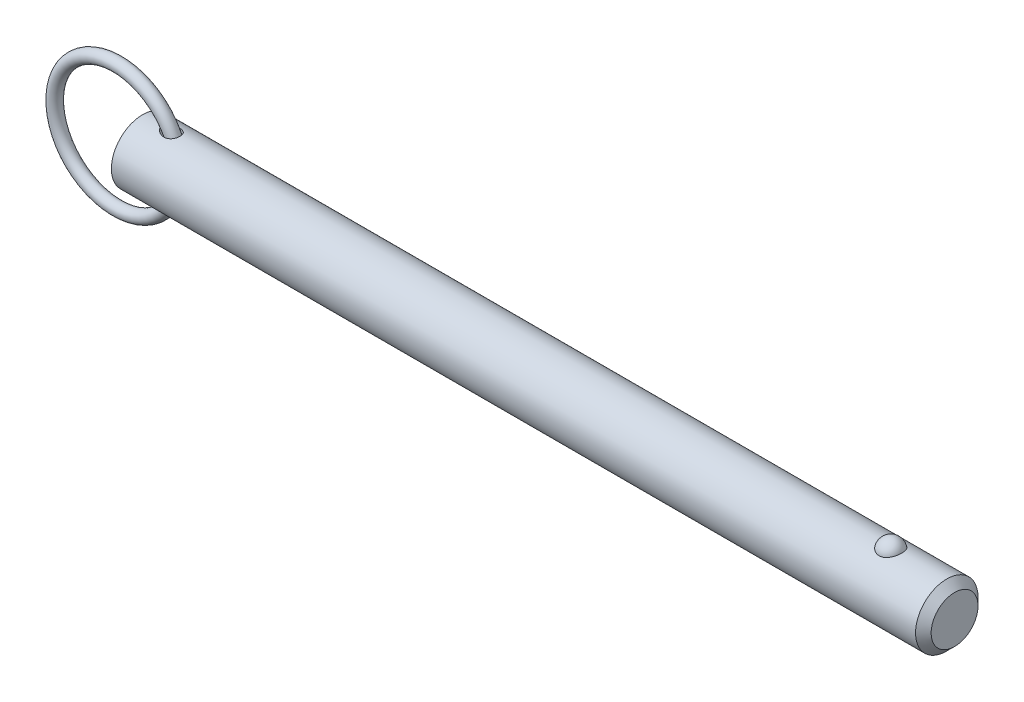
ISO-10303-21;
HEADER;
FILE_DESCRIPTION(('STEP AP214'),'2;1');
FILE_NAME('part.step','',(''),(''),'','','');
FILE_SCHEMA(('AUTOMOTIVE_DESIGN { 1 0 10303 214 1 1 1 1 }'));
ENDSEC;
DATA;
#1=APPLICATION_CONTEXT('core data for automotive mechanical design processes');
#2=APPLICATION_PROTOCOL_DEFINITION('international standard','automotive_design',2000,#1);
#3=PRODUCT_CONTEXT('',#1,'mechanical');
#4=PRODUCT('Part','Part','',(#3));
#5=PRODUCT_RELATED_PRODUCT_CATEGORY('part','',(#4));
#6=PRODUCT_DEFINITION_FORMATION('','',#4);
#7=PRODUCT_DEFINITION_CONTEXT('part definition',#1,'design');
#8=PRODUCT_DEFINITION('design','',#6,#7);
#9=PRODUCT_DEFINITION_SHAPE('','',#8);
#10=(LENGTH_UNIT() NAMED_UNIT(*) SI_UNIT(.MILLI.,.METRE.));
#11=(NAMED_UNIT(*) PLANE_ANGLE_UNIT() SI_UNIT($,.RADIAN.));
#12=(NAMED_UNIT(*) SI_UNIT($,.STERADIAN.) SOLID_ANGLE_UNIT());
#13=UNCERTAINTY_MEASURE_WITH_UNIT(LENGTH_MEASURE(1.E-05),#10,'distance_accuracy_value','');
#14=(GEOMETRIC_REPRESENTATION_CONTEXT(3) GLOBAL_UNCERTAINTY_ASSIGNED_CONTEXT((#13)) GLOBAL_UNIT_ASSIGNED_CONTEXT((#10,
#11,#12)) REPRESENTATION_CONTEXT('',''));
#15=CARTESIAN_POINT('',(0.,0.,0.));
#16=DIRECTION('',(0.,0.,1.));
#17=DIRECTION('',(1.,0.,0.));
#18=AXIS2_PLACEMENT_3D('',#15,#16,#17);
#19=CARTESIAN_POINT('',(-6.46799987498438,0.,0.));
#20=DIRECTION('',(0.,0.,1.));
#21=DIRECTION('',(1.,0.,0.));
#22=AXIS2_PLACEMENT_3D('',#19,#20,#21);
#23=TOROIDAL_SURFACE('',#22,15.875,1.588);
#24=CARTESIAN_POINT('',(10.9950001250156,0.,0.));
#25=VERTEX_POINT('',#24);
#26=VERTEX_LOOP('',#25);
#27=FACE_BOUND('',#26,.T.);
#28=ADVANCED_FACE('P0_F12',(#27),#23,.T.);
#29=CLOSED_SHELL('',(#28));
#30=MANIFOLD_SOLID_BREP('P0_B1',#29);
#31=CARTESIAN_POINT('',(0.,0.,0.));
#32=DIRECTION('',(1.,0.,0.));
#33=DIRECTION('',(0.,0.,-1.));
#34=AXIS2_PLACEMENT_3D('',#31,#32,#33);
#35=CYLINDRICAL_SURFACE('',#34,7.94);
#36=CARTESIAN_POINT('',(5.37881269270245,7.8641200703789,-1.0950869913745));
#37=CARTESIAN_POINT('',(5.49078530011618,7.84653010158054,-1.22142628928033));
#38=CARTESIAN_POINT('',(5.61742164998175,7.82766483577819,-1.33478448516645));
#39=CARTESIAN_POINT('',(5.82155225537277,7.80005811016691,-1.48501770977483));
#40=CARTESIAN_POINT('',(5.89211597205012,7.79095331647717,-1.53186949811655));
#41=CARTESIAN_POINT('',(6.03726296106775,7.77331484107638,-1.61899652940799));
#42=CARTESIAN_POINT('',(6.11184478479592,7.76478095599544,-1.65927412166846));
#43=CARTESIAN_POINT('',(6.31831542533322,7.74290334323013,-1.75933205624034));
#44=CARTESIAN_POINT('',(6.45343253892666,7.73042593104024,-1.81276183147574));
#45=CARTESIAN_POINT('',(6.73017339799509,7.70966096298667,-1.89912673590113));
#46=CARTESIAN_POINT('',(6.87179099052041,7.70136953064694,-1.93208083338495));
#47=CARTESIAN_POINT('',(7.17522096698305,7.6896684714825,-1.97820987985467));
#48=CARTESIAN_POINT('',(7.33750100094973,7.68691980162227,-1.98871513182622));
#49=CARTESIAN_POINT('',(7.57994245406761,7.68880305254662,-1.98137951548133));
#50=CARTESIAN_POINT('',(7.66059155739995,7.69043175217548,-1.97508575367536));
#51=CARTESIAN_POINT('',(7.82077465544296,7.69570110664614,-1.95445819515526));
#52=CARTESIAN_POINT('',(7.9003091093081,7.69934090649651,-1.94012781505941));
#53=CARTESIAN_POINT('',(8.09280087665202,7.71066069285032,-1.89475688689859));
#54=CARTESIAN_POINT('',(8.20465204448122,7.71942251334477,-1.85909462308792));
#55=CARTESIAN_POINT('',(8.42059371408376,7.74035594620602,-1.7699066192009));
#56=CARTESIAN_POINT('',(8.52468939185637,7.75252525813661,-1.7163929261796));
#57=CARTESIAN_POINT('',(8.72211003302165,7.77903750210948,-1.59192358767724));
#58=CARTESIAN_POINT('',(8.81539818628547,7.79338749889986,-1.52091076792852));
#59=CARTESIAN_POINT('',(8.98759177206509,7.8225086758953,-1.36321590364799));
#60=CARTESIAN_POINT('',(9.06649712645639,7.83727985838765,-1.27653377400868));
#61=CARTESIAN_POINT('',(9.20311499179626,7.86453692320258,-1.09567667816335));
#62=CARTESIAN_POINT('',(9.26180839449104,7.8771064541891,-1.00225329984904));
#63=CARTESIAN_POINT('',(9.36257622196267,7.89954213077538,-0.8065472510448));
#64=CARTESIAN_POINT('',(9.40465301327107,7.9094086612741,-0.704265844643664));
#65=CARTESIAN_POINT('',(9.47062404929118,7.92520709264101,-0.495461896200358));
#66=CARTESIAN_POINT('',(9.49478817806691,7.9311972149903,-0.389028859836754));
#67=CARTESIAN_POINT('',(9.52544004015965,7.93883641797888,-0.173494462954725));
#68=CARTESIAN_POINT('',(9.5319278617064,7.94048552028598,-0.0643931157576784));
#69=CARTESIAN_POINT('',(9.52707996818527,7.93926454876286,0.153487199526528));
#70=CARTESIAN_POINT('',(9.51572796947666,7.93639034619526,0.26226578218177));
#71=CARTESIAN_POINT('',(9.47542322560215,7.92642470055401,0.476313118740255));
#72=CARTESIAN_POINT('',(9.44647056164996,7.91933327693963,0.581581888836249));
#73=CARTESIAN_POINT('',(9.3716401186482,7.90170355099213,0.785602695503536));
#74=CARTESIAN_POINT('',(9.32576415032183,7.89116561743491,0.884355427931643));
#75=CARTESIAN_POINT('',(9.21823065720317,7.8677977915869,1.07254831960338));
#76=CARTESIAN_POINT('',(9.15657431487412,7.85496807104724,1.16198917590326));
#77=CARTESIAN_POINT('',(9.01919194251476,7.82843688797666,1.32903649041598));
#78=CARTESIAN_POINT('',(8.94347744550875,7.81473614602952,1.40665255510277));
#79=CARTESIAN_POINT('',(8.78012086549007,7.7879321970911,1.5481977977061));
#80=CARTESIAN_POINT('',(8.69247914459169,7.77482897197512,1.61212739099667));
#81=CARTESIAN_POINT('',(8.50642314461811,7.75037063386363,1.72592270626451));
#82=CARTESIAN_POINT('',(8.40786430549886,7.73904540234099,1.77555777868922));
#83=CARTESIAN_POINT('',(8.2039870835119,7.71943979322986,1.85894844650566));
#84=CARTESIAN_POINT('',(8.0986670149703,7.7111601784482,1.89270006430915));
#85=CARTESIAN_POINT('',(7.87703213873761,7.69782475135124,1.94625652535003));
#86=CARTESIAN_POINT('',(7.76044899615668,7.69301557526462,1.96500324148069));
#87=CARTESIAN_POINT('',(7.52574256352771,7.68770484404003,1.98567257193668));
#88=CARTESIAN_POINT('',(7.40761868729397,7.68720497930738,1.98758858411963));
#89=CARTESIAN_POINT('',(7.15639592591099,7.69044495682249,1.97502233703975));
#90=CARTESIAN_POINT('',(7.02341871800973,7.69476380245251,1.9583009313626));
#91=CARTESIAN_POINT('',(6.7612589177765,7.70776394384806,1.90648094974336));
#92=CARTESIAN_POINT('',(6.6320804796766,7.71644984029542,1.87136299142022));
#93=CARTESIAN_POINT('',(6.35978215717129,7.73875442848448,1.77707737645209));
#94=CARTESIAN_POINT('',(6.2177212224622,7.75293863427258,1.71496895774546));
#95=CARTESIAN_POINT('',(5.94559201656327,7.78383102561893,1.56880760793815));
#96=CARTESIAN_POINT('',(5.81552062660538,7.80053855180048,1.48476040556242));
#97=CARTESIAN_POINT('',(5.60081087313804,7.83035955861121,1.31701356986));
#98=CARTESIAN_POINT('',(5.51265224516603,7.84340226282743,1.23780647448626));
#99=CARTESIAN_POINT('',(5.34976240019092,7.86852524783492,1.06647953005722));
#100=CARTESIAN_POINT('',(5.27500719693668,7.88060722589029,0.974383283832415));
#101=CARTESIAN_POINT('',(5.15877594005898,7.89990441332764,0.800548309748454));
#102=CARTESIAN_POINT('',(5.11360209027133,7.90759876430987,0.721348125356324));
#103=CARTESIAN_POINT('',(5.03655060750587,7.92090267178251,0.556518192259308));
#104=CARTESIAN_POINT('',(5.00466157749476,7.92651401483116,0.470894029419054));
#105=CARTESIAN_POINT('',(4.95653766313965,7.93503671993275,0.294356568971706));
#106=CARTESIAN_POINT('',(4.94043621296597,7.93792505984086,0.203404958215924));
#107=CARTESIAN_POINT('',(4.92605720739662,7.94050250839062,0.0200631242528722));
#108=CARTESIAN_POINT('',(4.92776929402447,7.9401934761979,-0.072326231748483));
#109=CARTESIAN_POINT('',(4.94742735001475,7.93667454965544,-0.24325091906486));
#110=CARTESIAN_POINT('',(4.96327131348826,7.93384031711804,-0.32204819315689));
#111=CARTESIAN_POINT('',(5.00707570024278,7.92609115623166,-0.47605810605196));
#112=CARTESIAN_POINT('',(5.0350396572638,7.92117562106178,-0.551269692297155));
#113=CARTESIAN_POINT('',(5.10737112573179,7.90866290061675,-0.70999547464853));
#114=CARTESIAN_POINT('',(5.15379379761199,7.90074105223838,-0.792541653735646));
#115=CARTESIAN_POINT('',(5.2582083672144,7.88338732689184,-0.949781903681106));
#116=CARTESIAN_POINT('',(5.31621941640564,7.87395295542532,-1.02446265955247));
#117=CARTESIAN_POINT('',(5.37881269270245,7.8641200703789,-1.0950869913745));
#118=B_SPLINE_CURVE_WITH_KNOTS('',3,(#36,#37,#38,#39,#40,#41,#42,#43,#44,#45,#46,#47,#48,#49,
#50,#51,#52,#53,#54,#55,#56,#57,#58,#59,#60,#61,#62,#63,#64,#65,#66,#67,#68,#69,#70,#71,#72,#73,
#74,#75,#76,#77,#78,#79,#80,#81,#82,#83,#84,#85,#86,#87,#88,#89,#90,#91,#92,#93,#94,#95,#96,#97,
#98,#99,#100,#101,#102,#103,#104,#105,#106,#107,#108,#109,#110,#111,#112,#113,#114,#115,#116,
#117),.UNSPECIFIED.,.T.,.F.,(4,2,2,2,2,2,2,2,2,2,2,2,2,2,2,2,2,2,2,2,2,2,2,2,2,2,2,2,2,2,2,2,2,
2,2,2,2,2,2,2,4),(0.,0.508599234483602,0.763935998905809,1.01918131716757,1.45492798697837,
1.89027038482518,2.37502798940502,2.61739702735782,2.8596631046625,3.21120678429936,
3.56251370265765,3.91498401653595,4.26745624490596,4.59897839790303,4.93045331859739,
5.2568264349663,5.58319792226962,5.909867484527,6.23653553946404,6.56316865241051,
6.88977729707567,7.21611917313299,7.54245114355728,7.87378632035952,8.20520442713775,
8.55832700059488,8.91158808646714,9.31234018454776,9.71351536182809,10.1786231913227,
10.6436096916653,11.0001264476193,11.3559986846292,11.6294791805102,11.9027245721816,
12.1782599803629,12.4536351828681,12.693828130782,12.9340911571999,13.2179277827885,
13.5022374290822),.UNSPECIFIED.);
#119=CARTESIAN_POINT('',(5.37881269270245,7.8641200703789,-1.0950869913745));
#120=VERTEX_POINT('',#119);
#121=EDGE_CURVE('P1_E40',#120,#120,#118,.T.);
#122=ORIENTED_EDGE('',*,*,#121,.T.);
#123=EDGE_LOOP('',(#122));
#124=FACE_BOUND('',#123,.T.);
#125=CARTESIAN_POINT('',(204.395,0.,0.));
#126=DIRECTION('',(1.,0.,0.));
#127=DIRECTION('',(0.,0.,-1.));
#128=AXIS2_PLACEMENT_3D('',#125,#126,#127);
#129=CIRCLE('',#128,7.94);
#130=CARTESIAN_POINT('',(204.395,0.,-7.94));
#131=VERTEX_POINT('',#130);
#132=EDGE_CURVE('P1_E25',#131,#131,#129,.T.);
#133=ORIENTED_EDGE('',*,*,#132,.F.);
#134=EDGE_LOOP('',(#133));
#135=FACE_BOUND('',#134,.T.);
#136=CARTESIAN_POINT('',(0.,0.,0.));
#137=DIRECTION('',(1.,0.,0.));
#138=DIRECTION('',(0.,0.,-1.));
#139=AXIS2_PLACEMENT_3D('',#136,#137,#138);
#140=CIRCLE('',#139,7.94);
#141=CARTESIAN_POINT('',(0.,0.,-7.94));
#142=VERTEX_POINT('',#141);
#143=EDGE_CURVE('P1_E9',#142,#142,#140,.T.);
#144=ORIENTED_EDGE('',*,*,#143,.T.);
#145=EDGE_LOOP('',(#144));
#146=FACE_BOUND('',#145,.T.);
#147=CARTESIAN_POINT('',(190.164907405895,7.37767842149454,2.93486986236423));
#148=CARTESIAN_POINT('',(190.012749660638,7.3776732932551,2.93487505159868));
#149=CARTESIAN_POINT('',(189.860632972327,7.38258419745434,2.92262454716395));
#150=CARTESIAN_POINT('',(189.560928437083,7.40163229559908,2.87404196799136));
#151=CARTESIAN_POINT('',(189.413339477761,7.41576720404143,2.83771585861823));
#152=CARTESIAN_POINT('',(189.127018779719,7.45161576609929,2.74218769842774));
#153=CARTESIAN_POINT('',(188.988274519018,7.47331841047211,2.68301886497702));
#154=CARTESIAN_POINT('',(188.722882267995,7.52194082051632,2.54350967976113));
#155=CARTESIAN_POINT('',(188.596236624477,7.54886159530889,2.46316523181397));
#156=CARTESIAN_POINT('',(188.354534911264,7.60594671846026,2.28090375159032));
#157=CARTESIAN_POINT('',(188.239906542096,7.63618114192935,2.1784421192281));
#158=CARTESIAN_POINT('',(188.028878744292,7.69614046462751,1.95608495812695));
#159=CARTESIAN_POINT('',(187.932482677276,7.72586526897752,1.83618622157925));
#160=CARTESIAN_POINT('',(187.755938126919,7.78314821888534,1.57628086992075));
#161=CARTESIAN_POINT('',(187.676707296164,7.81055035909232,1.43561546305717));
#162=CARTESIAN_POINT('',(187.541797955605,7.85879631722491,1.142363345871));
#163=CARTESIAN_POINT('',(187.486121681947,7.87963951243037,0.989775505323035));
#164=CARTESIAN_POINT('',(187.39881215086,7.91289645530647,0.674619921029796));
#165=CARTESIAN_POINT('',(187.36753090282,7.92518652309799,0.511941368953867));
#166=CARTESIAN_POINT('',(187.330975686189,7.93958930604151,0.18324773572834));
#167=CARTESIAN_POINT('',(187.325701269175,7.94170219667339,0.017232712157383));
#168=CARTESIAN_POINT('',(187.341231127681,7.93554931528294,-0.31267286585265));
#169=CARTESIAN_POINT('',(187.361925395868,7.92732732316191,-0.476569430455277));
#170=CARTESIAN_POINT('',(187.42878655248,7.90141534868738,-0.798305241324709));
#171=CARTESIAN_POINT('',(187.474953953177,7.88372517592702,-0.956144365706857));
#172=CARTESIAN_POINT('',(187.591898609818,7.84066230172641,-1.26152073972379));
#173=CARTESIAN_POINT('',(187.662704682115,7.81528060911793,-1.40904568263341));
#174=CARTESIAN_POINT('',(187.827478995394,7.75948672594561,-1.68950598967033));
#175=CARTESIAN_POINT('',(187.921448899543,7.72907417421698,-1.82244030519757));
#176=CARTESIAN_POINT('',(188.130839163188,7.66640424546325,-2.07032792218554));
#177=CARTESIAN_POINT('',(188.246315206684,7.63414223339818,-2.18523308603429));
#178=CARTESIAN_POINT('',(188.4959006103,7.57149681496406,-2.39329737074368));
#179=CARTESIAN_POINT('',(188.630008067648,7.54111321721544,-2.48645870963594));
#180=CARTESIAN_POINT('',(188.910111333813,7.48650742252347,-2.64628132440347));
#181=CARTESIAN_POINT('',(189.055760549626,7.46215900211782,-2.71350554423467));
#182=CARTESIAN_POINT('',(189.357425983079,7.42171253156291,-2.82226614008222));
#183=CARTESIAN_POINT('',(189.513438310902,7.40561140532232,-2.86381209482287));
#184=CARTESIAN_POINT('',(189.822970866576,7.3842679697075,-2.9183907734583));
#185=CARTESIAN_POINT('',(189.976222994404,7.37852109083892,-2.93275024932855));
#186=CARTESIAN_POINT('',(190.283070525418,7.37700973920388,-2.93655208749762));
#187=CARTESIAN_POINT('',(190.436665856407,7.38124333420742,-2.92599927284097));
#188=CARTESIAN_POINT('',(190.734990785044,7.39890635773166,-2.88102897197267));
#189=CARTESIAN_POINT('',(190.879848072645,7.41205491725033,-2.84733999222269));
#190=CARTESIAN_POINT('',(191.16164329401,7.445801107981,-2.75788206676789));
#191=CARTESIAN_POINT('',(191.298580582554,7.46639934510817,-2.70211132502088));
#192=CARTESIAN_POINT('',(191.564061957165,7.51339098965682,-2.56858908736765));
#193=CARTESIAN_POINT('',(191.692354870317,7.53990200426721,-2.4903806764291));
#194=CARTESIAN_POINT('',(191.934244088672,7.59569503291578,-2.31462737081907));
#195=CARTESIAN_POINT('',(192.047837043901,7.6249776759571,-2.21707808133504));
#196=CARTESIAN_POINT('',(192.26322156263,7.68489473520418,-1.99982049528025));
#197=CARTESIAN_POINT('',(192.364148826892,7.71552419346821,-1.87925337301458));
#198=CARTESIAN_POINT('',(192.545186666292,7.77353016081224,-1.6226882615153));
#199=CARTESIAN_POINT('',(192.625293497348,7.80090608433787,-1.48668750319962));
#200=CARTESIAN_POINT('',(192.765361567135,7.85047992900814,-1.1981841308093));
#201=CARTESIAN_POINT('',(192.824587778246,7.87248183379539,-1.04529016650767));
#202=CARTESIAN_POINT('',(192.917982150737,7.90785114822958,-0.731080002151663));
#203=CARTESIAN_POINT('',(192.952149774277,7.92121837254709,-0.56976362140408));
#204=CARTESIAN_POINT('',(192.994795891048,7.93797834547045,-0.242812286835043));
#205=CARTESIAN_POINT('',(193.003204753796,7.94134405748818,-0.0771668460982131));
#206=CARTESIAN_POINT('',(192.993962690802,7.93767937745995,0.253276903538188));
#207=CARTESIAN_POINT('',(192.976312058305,7.93064910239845,0.418075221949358));
#208=CARTESIAN_POINT('',(192.915424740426,7.90695571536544,0.741525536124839));
#209=CARTESIAN_POINT('',(192.872281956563,7.8903279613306,0.900197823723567));
#210=CARTESIAN_POINT('',(192.76135358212,7.84916386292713,1.20759654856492));
#211=CARTESIAN_POINT('',(192.69356656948,7.82462706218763,1.35632241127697));
#212=CARTESIAN_POINT('',(192.534371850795,7.7700669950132,1.64032869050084));
#213=CARTESIAN_POINT('',(192.442861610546,7.7400200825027,1.7755471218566));
#214=CARTESIAN_POINT('',(192.238296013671,7.67774175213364,2.0280064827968));
#215=CARTESIAN_POINT('',(192.125241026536,7.64551037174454,2.14524772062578));
#216=CARTESIAN_POINT('',(191.880831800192,7.58265895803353,2.35778002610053));
#217=CARTESIAN_POINT('',(191.749583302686,7.5520309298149,2.45319004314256));
#218=CARTESIAN_POINT('',(191.471601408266,7.49579792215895,2.61999897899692));
#219=CARTESIAN_POINT('',(191.324867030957,7.47019326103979,2.69139637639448));
#220=CARTESIAN_POINT('',(191.012947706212,7.42622216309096,2.8105324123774));
#221=CARTESIAN_POINT('',(190.847220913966,7.40825002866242,2.85700910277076));
#222=CARTESIAN_POINT('',(190.509279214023,7.38398348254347,2.9191685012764));
#223=CARTESIAN_POINT('',(190.33706702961,7.3776842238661,2.93486399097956));
#224=CARTESIAN_POINT('',(190.164907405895,7.37767842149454,2.93486986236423));
#225=B_SPLINE_CURVE_WITH_KNOTS('',3,(#147,#148,#149,#150,#151,#152,#153,#154,#155,#156,#157,
#158,#159,#160,#161,#162,#163,#164,#165,#166,#167,#168,#169,#170,#171,#172,#173,#174,#175,#176,
#177,#178,#179,#180,#181,#182,#183,#184,#185,#186,#187,#188,#189,#190,#191,#192,#193,#194,#195,
#196,#197,#198,#199,#200,#201,#202,#203,#204,#205,#206,#207,#208,#209,#210,#211,#212,#213,#214,
#215,#216,#217,#218,#219,#220,#221,#222,#223,#224),.UNSPECIFIED.,.T.,.F.,(4,2,2,2,2,2,2,2,2,2,2,
2,2,2,2,2,2,2,2,2,2,2,2,2,2,2,2,2,2,2,2,2,2,2,2,2,2,2,4),(0.,0.455841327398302,
0.911569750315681,1.36663794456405,1.82179423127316,2.28978983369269,2.75787163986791,
3.24685368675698,3.73588214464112,4.23184282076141,4.72779494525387,5.22165321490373,
5.71552141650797,6.2099691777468,6.7044524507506,7.20023431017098,7.69596557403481,
8.18023418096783,8.66432203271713,9.12410697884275,9.58380291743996,10.0296503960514,
10.4755341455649,10.9312349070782,11.3870393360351,11.8654416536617,12.3439299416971,
12.8378875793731,13.3318558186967,13.8271581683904,14.3224549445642,14.8159385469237,
15.3094506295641,15.8051323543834,16.3008055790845,16.7937101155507,17.2866458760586,
17.8026240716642,18.3183879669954),.UNSPECIFIED.);
#226=CARTESIAN_POINT('',(190.164907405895,7.37767842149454,2.93486986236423));
#227=VERTEX_POINT('',#226);
#228=EDGE_CURVE('P1_E34',#227,#227,#225,.T.);
#229=ORIENTED_EDGE('',*,*,#228,.T.);
#230=EDGE_LOOP('',(#229));
#231=FACE_BOUND('',#230,.T.);
#232=CARTESIAN_POINT('',(5.37881269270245,-7.8641200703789,-1.0950869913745));
#233=CARTESIAN_POINT('',(5.31532711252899,-7.87409326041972,-1.02345575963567));
#234=CARTESIAN_POINT('',(5.25654962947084,-7.88365715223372,-0.947641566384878));
#235=CARTESIAN_POINT('',(5.15093536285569,-7.90122221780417,-0.787865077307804));
#236=CARTESIAN_POINT('',(5.10408931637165,-7.90922460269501,-0.703909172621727));
#237=CARTESIAN_POINT('',(5.02499142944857,-7.92292057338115,-0.527991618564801));
#238=CARTESIAN_POINT('',(4.99290048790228,-7.92858863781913,-0.435954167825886));
#239=CARTESIAN_POINT('',(4.94718343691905,-7.93670712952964,-0.247266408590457));
#240=CARTESIAN_POINT('',(4.93353142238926,-7.93916207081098,-0.150622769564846));
#241=CARTESIAN_POINT('',(4.92669426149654,-7.94038957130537,0.0306459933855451));
#242=CARTESIAN_POINT('',(4.93105622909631,-7.93960347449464,0.115182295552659));
#243=CARTESIAN_POINT('',(4.95441758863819,-7.93542535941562,0.282133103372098));
#244=CARTESIAN_POINT('',(4.97342060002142,-7.93203269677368,0.364547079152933));
#245=CARTESIAN_POINT('',(5.02337664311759,-7.92322764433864,0.521528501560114));
#246=CARTESIAN_POINT('',(5.05377582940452,-7.91790920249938,0.596281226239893));
#247=CARTESIAN_POINT('',(5.1246872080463,-7.90571364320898,0.740640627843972));
#248=CARTESIAN_POINT('',(5.16520358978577,-7.89883588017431,0.81024515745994));
#249=CARTESIAN_POINT('',(5.27792634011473,-7.88012470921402,0.978620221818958));
#250=CARTESIAN_POINT('',(5.35563200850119,-7.86757912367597,1.07363778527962));
#251=CARTESIAN_POINT('',(5.52523836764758,-7.84150676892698,1.24994147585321));
#252=CARTESIAN_POINT('',(5.61717506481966,-7.82797755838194,1.33119164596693));
#253=CARTESIAN_POINT('',(5.8391371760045,-7.79742756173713,1.50104748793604));
#254=CARTESIAN_POINT('',(5.9725742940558,-7.78050347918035,1.58521567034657));
#255=CARTESIAN_POINT('',(6.25160600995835,-7.74942135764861,1.73078109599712));
#256=CARTESIAN_POINT('',(6.39720857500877,-7.73526515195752,1.79216327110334));
#257=CARTESIAN_POINT('',(6.69793322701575,-7.7116170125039,1.89134478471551));
#258=CARTESIAN_POINT('',(6.85312134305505,-7.70216275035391,1.92895428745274));
#259=CARTESIAN_POINT('',(7.16781951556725,-7.68988337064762,1.97736316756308));
#260=CARTESIAN_POINT('',(7.32732244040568,-7.68704791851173,1.98820434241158));
#261=CARTESIAN_POINT('',(7.61290770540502,-7.68890797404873,1.98097687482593));
#262=CARTESIAN_POINT('',(7.73913797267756,-7.69217875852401,1.96837928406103));
#263=CARTESIAN_POINT('',(7.98774248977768,-7.70364253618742,1.92303262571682));
#264=CARTESIAN_POINT('',(8.11011880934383,-7.71183283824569,1.89029457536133));
#265=CARTESIAN_POINT('',(8.34766306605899,-7.73253074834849,1.80375920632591));
#266=CARTESIAN_POINT('',(8.46278682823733,-7.74506226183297,1.74984505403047));
#267=CARTESIAN_POINT('',(8.6806268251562,-7.77294147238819,1.62149891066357));
#268=CARTESIAN_POINT('',(8.78334736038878,-7.78828818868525,1.54707406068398));
#269=CARTESIAN_POINT('',(8.96275951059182,-7.81808719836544,1.38814746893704));
#270=CARTESIAN_POINT('',(9.0410292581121,-7.83247448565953,1.30540890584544));
#271=CARTESIAN_POINT('',(9.18176824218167,-7.86008608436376,1.12727331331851));
#272=CARTESIAN_POINT('',(9.24424163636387,-7.87331070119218,1.03187962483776));
#273=CARTESIAN_POINT('',(9.34924815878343,-7.89649032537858,0.835684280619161));
#274=CARTESIAN_POINT('',(9.39252490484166,-7.90656172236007,0.735293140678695));
#275=CARTESIAN_POINT('',(9.46188913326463,-7.92307290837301,0.528458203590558));
#276=CARTESIAN_POINT('',(9.48797767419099,-7.92951292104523,0.422014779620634));
#277=CARTESIAN_POINT('',(9.5222867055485,-7.93804067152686,0.20658939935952));
#278=CARTESIAN_POINT('',(9.53058328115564,-7.94014694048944,0.0976202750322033));
#279=CARTESIAN_POINT('',(9.52935292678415,-7.93983698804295,-0.120212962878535));
#280=CARTESIAN_POINT('',(9.51982577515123,-7.93742071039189,-0.229077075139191));
#281=CARTESIAN_POINT('',(9.48313466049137,-7.92831916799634,-0.44375138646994));
#282=CARTESIAN_POINT('',(9.45594838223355,-7.92162850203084,-0.549557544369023));
#283=CARTESIAN_POINT('',(9.3845465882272,-7.90469917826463,-0.754954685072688));
#284=CARTESIAN_POINT('',(9.34033171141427,-7.89446065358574,-0.854545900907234));
#285=CARTESIAN_POINT('',(9.23602927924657,-7.87157146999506,-1.04456732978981));
#286=CARTESIAN_POINT('',(9.17596171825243,-7.85892385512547,-1.13500888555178));
#287=CARTESIAN_POINT('',(9.04153430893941,-7.83259746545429,-1.30436780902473));
#288=CARTESIAN_POINT('',(8.96717562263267,-7.81891877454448,-1.38328611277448));
#289=CARTESIAN_POINT('',(8.80603455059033,-7.79196869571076,-1.52782923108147));
#290=CARTESIAN_POINT('',(8.71921490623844,-7.77869867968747,-1.59341269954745));
#291=CARTESIAN_POINT('',(8.53589430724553,-7.7539823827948,-1.7096493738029));
#292=CARTESIAN_POINT('',(8.439392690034,-7.74253622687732,-1.76030155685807));
#293=CARTESIAN_POINT('',(8.23614706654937,-7.72219212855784,-1.84754820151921));
#294=CARTESIAN_POINT('',(8.12916866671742,-7.71339202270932,-1.88361685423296));
#295=CARTESIAN_POINT('',(7.91082287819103,-7.69955300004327,-1.93940887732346));
#296=CARTESIAN_POINT('',(7.79945379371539,-7.69451555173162,-1.95912586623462));
#297=CARTESIAN_POINT('',(7.56409927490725,-7.6881073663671,-1.98413612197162));
#298=CARTESIAN_POINT('',(7.43993744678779,-7.68713944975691,-1.98784574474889));
#299=CARTESIAN_POINT('',(7.19239878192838,-7.68969629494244,-1.97792309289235));
#300=CARTESIAN_POINT('',(7.06902225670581,-7.69322274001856,-1.96428432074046));
#301=CARTESIAN_POINT('',(6.80624991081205,-7.70498367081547,-1.91768089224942));
#302=CARTESIAN_POINT('',(6.66736121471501,-7.71386737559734,-1.88203087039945));
#303=CARTESIAN_POINT('',(6.39625444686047,-7.73551250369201,-1.79098714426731));
#304=CARTESIAN_POINT('',(6.26404857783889,-7.74828074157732,-1.73555871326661));
#305=CARTESIAN_POINT('',(6.06559048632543,-7.77003865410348,-1.63446133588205));
#306=CARTESIAN_POINT('',(5.99591479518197,-7.77821880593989,-1.59522999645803));
#307=CARTESIAN_POINT('',(5.86025875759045,-7.79503524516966,-1.51091846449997));
#308=CARTESIAN_POINT('',(5.79427944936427,-7.8036716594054,-1.46583664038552));
#309=CARTESIAN_POINT('',(5.60322733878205,-7.82978128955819,-1.3219827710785));
#310=CARTESIAN_POINT('',(5.48449649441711,-7.84751780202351,-1.21433077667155));
#311=CARTESIAN_POINT('',(5.37881269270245,-7.8641200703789,-1.0950869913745));
#312=B_SPLINE_CURVE_WITH_KNOTS('',3,(#232,#233,#234,#235,#236,#237,#238,#239,#240,#241,#242,
#243,#244,#245,#246,#247,#248,#249,#250,#251,#252,#253,#254,#255,#256,#257,#258,#259,#260,#261,
#262,#263,#264,#265,#266,#267,#268,#269,#270,#271,#272,#273,#274,#275,#276,#277,#278,#279,#280,
#281,#282,#283,#284,#285,#286,#287,#288,#289,#290,#291,#292,#293,#294,#295,#296,#297,#298,#299,
#300,#301,#302,#303,#304,#305,#306,#307,#308,#309,#310,#311),.UNSPECIFIED.,.T.,.F.,(4,2,2,2,2,2,
2,2,2,2,2,2,2,2,2,2,2,2,2,2,2,2,2,2,2,2,2,2,2,2,2,2,2,2,2,2,2,2,2,4),(0.,0.288363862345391,
0.576503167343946,0.867714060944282,1.15851540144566,1.41111828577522,1.66378363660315,
1.90549406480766,2.1473047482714,2.51540453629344,2.88445136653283,3.35805159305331,
3.83196445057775,4.30961543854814,4.78652012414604,5.16565662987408,5.54458592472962,
5.92563591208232,6.30655339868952,6.64920782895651,6.99177197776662,7.31956587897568,
7.64733959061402,7.97370879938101,8.30008206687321,8.62686856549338,8.95364280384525,
9.28000684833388,9.60634436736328,9.93367879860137,10.261035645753,10.59932199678,
10.9377403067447,11.308967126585,11.6803330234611,12.1096921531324,12.5398088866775,
12.7806650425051,13.0215885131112,13.5016249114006),.UNSPECIFIED.);
#313=CARTESIAN_POINT('',(5.37881269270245,-7.8641200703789,-1.0950869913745));
#314=VERTEX_POINT('',#313);
#315=EDGE_CURVE('P1_E17',#314,#314,#312,.T.);
#316=ORIENTED_EDGE('',*,*,#315,.T.);
#317=EDGE_LOOP('',(#316));
#318=FACE_BOUND('',#317,.T.);
#319=ADVANCED_FACE('P1_F13',(#124,#135,#146,#231,#318),#35,.T.);
#320=CARTESIAN_POINT('',(0.,0.,0.));
#321=DIRECTION('',(-1.,0.,0.));
#322=DIRECTION('',(0.,0.,1.));
#323=AXIS2_PLACEMENT_3D('',#320,#321,#322);
#324=PLANE('',#323);
#325=ORIENTED_EDGE('',*,*,#143,.F.);
#326=EDGE_LOOP('',(#325));
#327=FACE_BOUND('',#326,.T.);
#328=ADVANCED_FACE('P1_F15',(#327),#324,.T.);
#329=CARTESIAN_POINT('',(206.38,0.,0.));
#330=DIRECTION('',(-1.,0.,0.));
#331=DIRECTION('',(0.,0.,1.));
#332=AXIS2_PLACEMENT_3D('',#329,#330,#331);
#333=CONICAL_SURFACE('',#332,5.95500000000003,0.785398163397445);
#334=ORIENTED_EDGE('',*,*,#132,.T.);
#335=EDGE_LOOP('',(#334));
#336=FACE_BOUND('',#335,.T.);
#337=CARTESIAN_POINT('',(206.38,0.,0.));
#338=DIRECTION('',(1.,0.,0.));
#339=DIRECTION('',(0.,0.,-1.));
#340=AXIS2_PLACEMENT_3D('',#337,#338,#339);
#341=CIRCLE('',#340,5.95500000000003);
#342=CARTESIAN_POINT('',(206.38,0.,-5.95500000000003));
#343=VERTEX_POINT('',#342);
#344=EDGE_CURVE('P1_E30',#343,#343,#341,.T.);
#345=ORIENTED_EDGE('',*,*,#344,.F.);
#346=EDGE_LOOP('',(#345));
#347=FACE_BOUND('',#346,.T.);
#348=ADVANCED_FACE('P1_F55',(#336,#347),#333,.T.);
#349=CARTESIAN_POINT('',(206.38,5.95500000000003,0.));
#350=DIRECTION('',(1.,0.,0.));
#351=DIRECTION('',(0.,0.,-1.));
#352=AXIS2_PLACEMENT_3D('',#349,#350,#351);
#353=PLANE('',#352);
#354=ORIENTED_EDGE('',*,*,#344,.T.);
#355=EDGE_LOOP('',(#354));
#356=FACE_BOUND('',#355,.T.);
#357=ADVANCED_FACE('P1_F51',(#356),#353,.T.);
#358=CARTESIAN_POINT('',(190.164907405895,7.146,0.));
#359=DIRECTION('',(-1.,0.,0.));
#360=DIRECTION('',(0.,1.,0.));
#361=AXIS2_PLACEMENT_3D('',#358,#359,#360);
#362=SPHERICAL_SURFACE('',#361,2.944);
#363=ORIENTED_EDGE('',*,*,#228,.F.);
#364=EDGE_LOOP('',(#363));
#365=FACE_BOUND('',#364,.T.);
#366=ADVANCED_FACE('P1_F46',(#365),#362,.T.);
#367=CARTESIAN_POINT('',(-6.46799987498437,0.,0.));
#368=DIRECTION('',(0.,0.,1.));
#369=DIRECTION('',(1.,0.,0.));
#370=AXIS2_PLACEMENT_3D('',#367,#368,#369);
#371=TOROIDAL_SURFACE('',#370,15.875,1.985);
#372=ORIENTED_EDGE('',*,*,#315,.F.);
#373=EDGE_LOOP('',(#372));
#374=FACE_BOUND('',#373,.T.);
#375=ORIENTED_EDGE('',*,*,#121,.F.);
#376=EDGE_LOOP('',(#375));
#377=FACE_BOUND('',#376,.T.);
#378=ADVANCED_FACE('P1_F50',(#374,#377),#371,.F.);
#379=CLOSED_SHELL('',(#319,#328,#348,#357,#366,#378));
#380=MANIFOLD_SOLID_BREP('P1_B1',#379);
#381=ADVANCED_BREP_SHAPE_REPRESENTATION('',(#18,#30,#380),#14);
#382=SHAPE_DEFINITION_REPRESENTATION(#9,#381);
ENDSEC;
END-ISO-10303-21;
